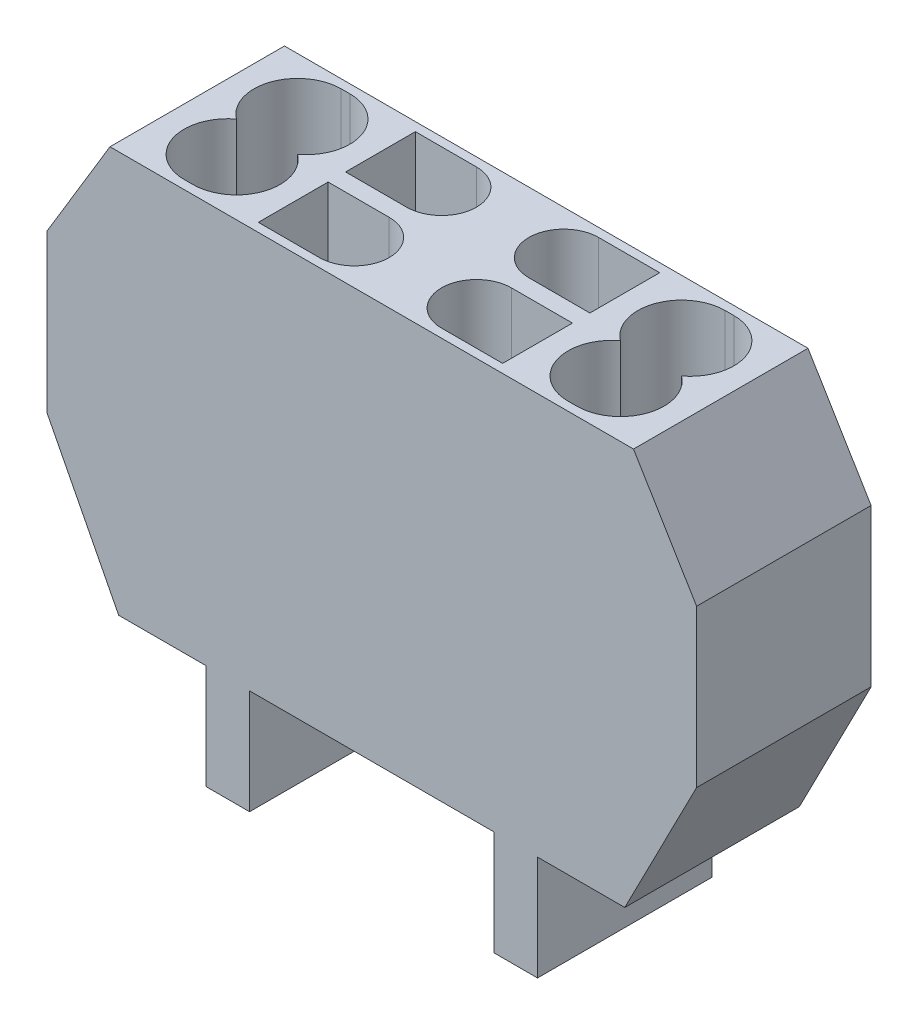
ISO-10303-21;
HEADER;
FILE_DESCRIPTION(('STEP AP214'),'2;1');
FILE_NAME('part.step','',(''),(''),'','','');
FILE_SCHEMA(('AUTOMOTIVE_DESIGN { 1 0 10303 214 1 1 1 1 }'));
ENDSEC;
DATA;
#1=APPLICATION_CONTEXT('core data for automotive mechanical design processes');
#2=APPLICATION_PROTOCOL_DEFINITION('international standard','automotive_design',2000,#1);
#3=PRODUCT_CONTEXT('',#1,'mechanical');
#4=PRODUCT('Part','Part','',(#3));
#5=PRODUCT_RELATED_PRODUCT_CATEGORY('part','',(#4));
#6=PRODUCT_DEFINITION_FORMATION('','',#4);
#7=PRODUCT_DEFINITION_CONTEXT('part definition',#1,'design');
#8=PRODUCT_DEFINITION('design','',#6,#7);
#9=PRODUCT_DEFINITION_SHAPE('','',#8);
#10=(LENGTH_UNIT() NAMED_UNIT(*) SI_UNIT(.MILLI.,.METRE.));
#11=(NAMED_UNIT(*) PLANE_ANGLE_UNIT() SI_UNIT($,.RADIAN.));
#12=(NAMED_UNIT(*) SI_UNIT($,.STERADIAN.) SOLID_ANGLE_UNIT());
#13=UNCERTAINTY_MEASURE_WITH_UNIT(LENGTH_MEASURE(1.E-05),#10,'distance_accuracy_value','');
#14=(GEOMETRIC_REPRESENTATION_CONTEXT(3) GLOBAL_UNCERTAINTY_ASSIGNED_CONTEXT((#13)) GLOBAL_UNIT_ASSIGNED_CONTEXT((#10,
#11,#12)) REPRESENTATION_CONTEXT('',''));
#15=CARTESIAN_POINT('',(0.,0.,0.));
#16=DIRECTION('',(0.,0.,1.));
#17=DIRECTION('',(1.,0.,0.));
#18=AXIS2_PLACEMENT_3D('',#15,#16,#17);
#19=CARTESIAN_POINT('',(7.,0.,10.));
#20=DIRECTION('',(1.,0.,0.));
#21=DIRECTION('',(0.,1.,0.));
#22=AXIS2_PLACEMENT_3D('',#19,#20,#21);
#23=PLANE('',#22);
#24=DIRECTION('',(0.,-1.,0.));
#25=VECTOR('',#24,1.);
#26=CARTESIAN_POINT('',(7.,0.,0.));
#27=LINE('',#26,#25);
#28=CARTESIAN_POINT('',(7.,0.,0.));
#29=VERTEX_POINT('',#28);
#30=CARTESIAN_POINT('',(7.,-6.,0.));
#31=VERTEX_POINT('',#30);
#32=EDGE_CURVE('E515',#29,#31,#27,.T.);
#33=ORIENTED_EDGE('',*,*,#32,.T.);
#34=DIRECTION('',(0.,0.,-1.));
#35=VECTOR('',#34,1.);
#36=CARTESIAN_POINT('',(7.,-6.,10.));
#37=LINE('',#36,#35);
#38=CARTESIAN_POINT('',(7.,-6.,10.));
#39=VERTEX_POINT('',#38);
#40=EDGE_CURVE('E11',#39,#31,#37,.T.);
#41=ORIENTED_EDGE('',*,*,#40,.F.);
#42=DIRECTION('',(0.,-1.,0.));
#43=VECTOR('',#42,1.);
#44=CARTESIAN_POINT('',(7.,0.,10.));
#45=LINE('',#44,#43);
#46=CARTESIAN_POINT('',(7.,0.,10.));
#47=VERTEX_POINT('',#46);
#48=EDGE_CURVE('E526',#47,#39,#45,.T.);
#49=ORIENTED_EDGE('',*,*,#48,.F.);
#50=DIRECTION('',(0.,0.,-1.));
#51=VECTOR('',#50,1.);
#52=CARTESIAN_POINT('',(7.,0.,10.));
#53=LINE('',#52,#51);
#54=EDGE_CURVE('E560',#47,#29,#53,.T.);
#55=ORIENTED_EDGE('',*,*,#54,.T.);
#56=EDGE_LOOP('',(#33,#41,#49,#55));
#57=FACE_BOUND('',#56,.T.);
#58=ADVANCED_FACE('F17',(#57),#23,.F.);
#59=CARTESIAN_POINT('',(7.,-6.,10.));
#60=DIRECTION('',(0.,1.,0.));
#61=DIRECTION('',(0.,0.,1.));
#62=AXIS2_PLACEMENT_3D('',#59,#60,#61);
#63=PLANE('',#62);
#64=DIRECTION('',(1.,0.,0.));
#65=VECTOR('',#64,1.);
#66=CARTESIAN_POINT('',(7.,-6.,0.));
#67=LINE('',#66,#65);
#68=CARTESIAN_POINT('',(9.5,-6.,0.));
#69=VERTEX_POINT('',#68);
#70=EDGE_CURVE('E563',#31,#69,#67,.T.);
#71=ORIENTED_EDGE('',*,*,#70,.T.);
#72=DIRECTION('',(0.,0.,-1.));
#73=VECTOR('',#72,1.);
#74=CARTESIAN_POINT('',(9.5,-6.,10.));
#75=LINE('',#74,#73);
#76=CARTESIAN_POINT('',(9.5,-6.,10.));
#77=VERTEX_POINT('',#76);
#78=EDGE_CURVE('E24',#77,#69,#75,.T.);
#79=ORIENTED_EDGE('',*,*,#78,.F.);
#80=DIRECTION('',(1.,0.,0.));
#81=VECTOR('',#80,1.);
#82=CARTESIAN_POINT('',(7.,-6.,10.));
#83=LINE('',#82,#81);
#84=EDGE_CURVE('E529',#39,#77,#83,.T.);
#85=ORIENTED_EDGE('',*,*,#84,.F.);
#86=ORIENTED_EDGE('',*,*,#40,.T.);
#87=EDGE_LOOP('',(#71,#79,#85,#86));
#88=FACE_BOUND('',#87,.T.);
#89=ADVANCED_FACE('F660',(#88),#63,.F.);
#90=CARTESIAN_POINT('',(9.5,-6.,10.));
#91=DIRECTION('',(-1.,0.,0.));
#92=DIRECTION('',(0.,0.,1.));
#93=AXIS2_PLACEMENT_3D('',#90,#91,#92);
#94=PLANE('',#93);
#95=DIRECTION('',(0.,1.,0.));
#96=VECTOR('',#95,1.);
#97=CARTESIAN_POINT('',(9.5,-6.,0.));
#98=LINE('',#97,#96);
#99=CARTESIAN_POINT('',(9.5,0.,0.));
#100=VERTEX_POINT('',#99);
#101=EDGE_CURVE('E565',#69,#100,#98,.T.);
#102=ORIENTED_EDGE('',*,*,#101,.T.);
#103=DIRECTION('',(0.,0.,-1.));
#104=VECTOR('',#103,1.);
#105=CARTESIAN_POINT('',(9.5,0.,10.));
#106=LINE('',#105,#104);
#107=CARTESIAN_POINT('',(9.5,0.,10.));
#108=VERTEX_POINT('',#107);
#109=EDGE_CURVE('E630',#108,#100,#106,.T.);
#110=ORIENTED_EDGE('',*,*,#109,.F.);
#111=DIRECTION('',(0.,1.,0.));
#112=VECTOR('',#111,1.);
#113=CARTESIAN_POINT('',(9.5,-6.,10.));
#114=LINE('',#113,#112);
#115=EDGE_CURVE('E532',#77,#108,#114,.T.);
#116=ORIENTED_EDGE('',*,*,#115,.F.);
#117=ORIENTED_EDGE('',*,*,#78,.T.);
#118=EDGE_LOOP('',(#102,#110,#116,#117));
#119=FACE_BOUND('',#118,.T.);
#120=ADVANCED_FACE('F637',(#119),#94,.F.);
#121=CARTESIAN_POINT('',(9.5,0.,10.));
#122=DIRECTION('',(0.,1.,0.));
#123=DIRECTION('',(0.,0.,1.));
#124=AXIS2_PLACEMENT_3D('',#121,#122,#123);
#125=PLANE('',#124);
#126=DIRECTION('',(1.,0.,0.));
#127=VECTOR('',#126,1.);
#128=CARTESIAN_POINT('',(9.5,0.,0.));
#129=LINE('',#128,#127);
#130=CARTESIAN_POINT('',(14.5,0.,0.));
#131=VERTEX_POINT('',#130);
#132=EDGE_CURVE('E567',#100,#131,#129,.T.);
#133=ORIENTED_EDGE('',*,*,#132,.T.);
#134=DIRECTION('',(0.,0.,-1.));
#135=VECTOR('',#134,1.);
#136=CARTESIAN_POINT('',(14.5,0.,10.));
#137=LINE('',#136,#135);
#138=CARTESIAN_POINT('',(14.5,0.,10.));
#139=VERTEX_POINT('',#138);
#140=EDGE_CURVE('E627',#139,#131,#137,.T.);
#141=ORIENTED_EDGE('',*,*,#140,.F.);
#142=DIRECTION('',(1.,0.,0.));
#143=VECTOR('',#142,1.);
#144=CARTESIAN_POINT('',(9.5,0.,10.));
#145=LINE('',#144,#143);
#146=EDGE_CURVE('E534',#108,#139,#145,.T.);
#147=ORIENTED_EDGE('',*,*,#146,.F.);
#148=ORIENTED_EDGE('',*,*,#109,.T.);
#149=EDGE_LOOP('',(#133,#141,#147,#148));
#150=FACE_BOUND('',#149,.T.);
#151=ADVANCED_FACE('F648',(#150),#125,.F.);
#152=CARTESIAN_POINT('',(14.5,0.,10.));
#153=DIRECTION('',(-0.889429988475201,0.457071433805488,0.));
#154=DIRECTION('',(-0.457071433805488,-0.889429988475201,0.));
#155=AXIS2_PLACEMENT_3D('',#152,#153,#154);
#156=PLANE('',#155);
#157=DIRECTION('',(0.457071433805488,0.889429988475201,0.));
#158=VECTOR('',#157,1.);
#159=CARTESIAN_POINT('',(14.5,0.,0.));
#160=LINE('',#159,#158);
#161=CARTESIAN_POINT('',(18.6136429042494,8.0048698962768,0.));
#162=VERTEX_POINT('',#161);
#163=EDGE_CURVE('E569',#131,#162,#160,.T.);
#164=ORIENTED_EDGE('',*,*,#163,.T.);
#165=DIRECTION('',(0.,0.,-1.));
#166=VECTOR('',#165,1.);
#167=CARTESIAN_POINT('',(18.6136429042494,8.0048698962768,10.));
#168=LINE('',#167,#166);
#169=CARTESIAN_POINT('',(18.6136429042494,8.0048698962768,10.));
#170=VERTEX_POINT('',#169);
#171=EDGE_CURVE('E624',#170,#162,#168,.T.);
#172=ORIENTED_EDGE('',*,*,#171,.F.);
#173=DIRECTION('',(0.457071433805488,0.889429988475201,0.));
#174=VECTOR('',#173,1.);
#175=CARTESIAN_POINT('',(14.5,0.,10.));
#176=LINE('',#175,#174);
#177=EDGE_CURVE('E536',#139,#170,#176,.T.);
#178=ORIENTED_EDGE('',*,*,#177,.F.);
#179=ORIENTED_EDGE('',*,*,#140,.T.);
#180=EDGE_LOOP('',(#164,#172,#178,#179));
#181=FACE_BOUND('',#180,.T.);
#182=ADVANCED_FACE('F652',(#181),#156,.F.);
#183=CARTESIAN_POINT('',(18.6136429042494,8.0048698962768,10.));
#184=DIRECTION('',(-1.,0.,0.));
#185=DIRECTION('',(0.,0.,1.));
#186=AXIS2_PLACEMENT_3D('',#183,#184,#185);
#187=PLANE('',#186);
#188=DIRECTION('',(0.,1.,0.));
#189=VECTOR('',#188,1.);
#190=CARTESIAN_POINT('',(18.6136429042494,8.0048698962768,0.));
#191=LINE('',#190,#189);
#192=CARTESIAN_POINT('',(18.6136429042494,17.0048698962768,0.));
#193=VERTEX_POINT('',#192);
#194=EDGE_CURVE('E571',#162,#193,#191,.T.);
#195=ORIENTED_EDGE('',*,*,#194,.T.);
#196=DIRECTION('',(0.,0.,-1.));
#197=VECTOR('',#196,1.);
#198=CARTESIAN_POINT('',(18.6136429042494,17.0048698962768,10.));
#199=LINE('',#198,#197);
#200=CARTESIAN_POINT('',(18.6136429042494,17.0048698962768,10.));
#201=VERTEX_POINT('',#200);
#202=EDGE_CURVE('E621',#201,#193,#199,.T.);
#203=ORIENTED_EDGE('',*,*,#202,.F.);
#204=DIRECTION('',(0.,1.,0.));
#205=VECTOR('',#204,1.);
#206=CARTESIAN_POINT('',(18.6136429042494,8.0048698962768,10.));
#207=LINE('',#206,#205);
#208=EDGE_CURVE('E538',#170,#201,#207,.T.);
#209=ORIENTED_EDGE('',*,*,#208,.F.);
#210=ORIENTED_EDGE('',*,*,#171,.T.);
#211=EDGE_LOOP('',(#195,#203,#209,#210));
#212=FACE_BOUND('',#211,.T.);
#213=ADVANCED_FACE('F713',(#212),#187,.F.);
#214=CARTESIAN_POINT('',(18.6136429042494,17.0048698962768,10.));
#215=DIRECTION('',(-0.856447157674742,-0.516234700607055,0.));
#216=DIRECTION('',(0.516234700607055,-0.856447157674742,0.));
#217=AXIS2_PLACEMENT_3D('',#214,#215,#216);
#218=PLANE('',#217);
#219=DIRECTION('',(-0.516234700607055,0.856447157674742,0.));
#220=VECTOR('',#219,1.);
#221=CARTESIAN_POINT('',(18.6136429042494,17.0048698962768,0.));
#222=LINE('',#221,#220);
#223=CARTESIAN_POINT('',(15.,23.,0.));
#224=VERTEX_POINT('',#223);
#225=EDGE_CURVE('E573',#193,#224,#222,.T.);
#226=ORIENTED_EDGE('',*,*,#225,.T.);
#227=DIRECTION('',(0.,0.,-1.));
#228=VECTOR('',#227,1.);
#229=CARTESIAN_POINT('',(15.,23.,10.));
#230=LINE('',#229,#228);
#231=CARTESIAN_POINT('',(15.,23.,10.));
#232=VERTEX_POINT('',#231);
#233=EDGE_CURVE('E618',#232,#224,#230,.T.);
#234=ORIENTED_EDGE('',*,*,#233,.F.);
#235=DIRECTION('',(-0.516234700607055,0.856447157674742,0.));
#236=VECTOR('',#235,1.);
#237=CARTESIAN_POINT('',(18.6136429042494,17.0048698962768,10.));
#238=LINE('',#237,#236);
#239=EDGE_CURVE('E540',#201,#232,#238,.T.);
#240=ORIENTED_EDGE('',*,*,#239,.F.);
#241=ORIENTED_EDGE('',*,*,#202,.T.);
#242=EDGE_LOOP('',(#226,#234,#240,#241));
#243=FACE_BOUND('',#242,.T.);
#244=ADVANCED_FACE('F710',(#243),#218,.F.);
#245=CARTESIAN_POINT('',(15.,23.,10.));
#246=DIRECTION('',(0.,-1.,0.));
#247=DIRECTION('',(0.,0.,-1.));
#248=AXIS2_PLACEMENT_3D('',#245,#246,#247);
#249=PLANE('',#248);
#250=DIRECTION('',(-1.,0.,0.));
#251=VECTOR('',#250,1.);
#252=CARTESIAN_POINT('',(-7.,23.,0.5));
#253=LINE('',#252,#251);
#254=CARTESIAN_POINT('',(-3.5,23.,0.5));
#255=VERTEX_POINT('',#254);
#256=CARTESIAN_POINT('',(-7.,23.,0.5));
#257=VERTEX_POINT('',#256);
#258=EDGE_CURVE('E326',#255,#257,#253,.T.);
#259=ORIENTED_EDGE('',*,*,#258,.F.);
#260=CARTESIAN_POINT('',(-3.5,23.,2.5));
#261=DIRECTION('',(0.,1.,0.));
#262=DIRECTION('',(0.,0.,-1.));
#263=AXIS2_PLACEMENT_3D('',#260,#261,#262);
#264=CIRCLE('',#263,2.);
#265=CARTESIAN_POINT('',(-3.5,23.,4.5));
#266=VERTEX_POINT('',#265);
#267=EDGE_CURVE('E31',#266,#255,#264,.T.);
#268=ORIENTED_EDGE('',*,*,#267,.F.);
#269=DIRECTION('',(1.,0.,0.));
#270=VECTOR('',#269,1.);
#271=CARTESIAN_POINT('',(-3.5,23.,4.5));
#272=LINE('',#271,#270);
#273=CARTESIAN_POINT('',(-7.,23.,4.5));
#274=VERTEX_POINT('',#273);
#275=EDGE_CURVE('E317',#274,#266,#272,.T.);
#276=ORIENTED_EDGE('',*,*,#275,.F.);
#277=DIRECTION('',(0.,0.,1.));
#278=VECTOR('',#277,1.);
#279=CARTESIAN_POINT('',(-7.,23.,4.5));
#280=LINE('',#279,#278);
#281=EDGE_CURVE('E320',#257,#274,#280,.T.);
#282=ORIENTED_EDGE('',*,*,#281,.F.);
#283=EDGE_LOOP('',(#259,#268,#276,#282));
#284=FACE_BOUND('',#283,.T.);
#285=DIRECTION('',(1.,0.,0.));
#286=VECTOR('',#285,1.);
#287=CARTESIAN_POINT('',(3.5,23.,4.5));
#288=LINE('',#287,#286);
#289=CARTESIAN_POINT('',(3.5,23.,4.5));
#290=VERTEX_POINT('',#289);
#291=CARTESIAN_POINT('',(7.,23.,4.5));
#292=VERTEX_POINT('',#291);
#293=EDGE_CURVE('E350',#290,#292,#288,.T.);
#294=ORIENTED_EDGE('',*,*,#293,.F.);
#295=CARTESIAN_POINT('',(3.5,23.,2.5));
#296=DIRECTION('',(0.,1.,0.));
#297=DIRECTION('',(0.,0.,1.));
#298=AXIS2_PLACEMENT_3D('',#295,#296,#297);
#299=CIRCLE('',#298,2.);
#300=CARTESIAN_POINT('',(3.5,23.,0.5));
#301=VERTEX_POINT('',#300);
#302=EDGE_CURVE('E39',#301,#290,#299,.T.);
#303=ORIENTED_EDGE('',*,*,#302,.F.);
#304=DIRECTION('',(-1.,0.,0.));
#305=VECTOR('',#304,1.);
#306=CARTESIAN_POINT('',(7.,23.,0.5));
#307=LINE('',#306,#305);
#308=CARTESIAN_POINT('',(7.,23.,0.5));
#309=VERTEX_POINT('',#308);
#310=EDGE_CURVE('E339',#309,#301,#307,.T.);
#311=ORIENTED_EDGE('',*,*,#310,.F.);
#312=DIRECTION('',(0.,0.,-1.));
#313=VECTOR('',#312,1.);
#314=CARTESIAN_POINT('',(7.,23.,4.5));
#315=LINE('',#314,#313);
#316=EDGE_CURVE('E353',#292,#309,#315,.T.);
#317=ORIENTED_EDGE('',*,*,#316,.F.);
#318=EDGE_LOOP('',(#294,#303,#311,#317));
#319=FACE_BOUND('',#318,.T.);
#320=DIRECTION('',(1.,0.,0.));
#321=VECTOR('',#320,1.);
#322=CARTESIAN_POINT('',(7.,23.,9.5));
#323=LINE('',#322,#321);
#324=CARTESIAN_POINT('',(3.5,23.,9.5));
#325=VERTEX_POINT('',#324);
#326=CARTESIAN_POINT('',(7.,23.,9.5));
#327=VERTEX_POINT('',#326);
#328=EDGE_CURVE('E381',#325,#327,#323,.T.);
#329=ORIENTED_EDGE('',*,*,#328,.F.);
#330=CARTESIAN_POINT('',(3.5,23.,7.5));
#331=DIRECTION('',(0.,1.,0.));
#332=DIRECTION('',(0.,0.,-1.));
#333=AXIS2_PLACEMENT_3D('',#330,#331,#332);
#334=CIRCLE('',#333,2.);
#335=CARTESIAN_POINT('',(3.5,23.,5.5));
#336=VERTEX_POINT('',#335);
#337=EDGE_CURVE('E360',#336,#325,#334,.T.);
#338=ORIENTED_EDGE('',*,*,#337,.F.);
#339=DIRECTION('',(-1.,0.,0.));
#340=VECTOR('',#339,1.);
#341=CARTESIAN_POINT('',(3.5,23.,5.5));
#342=LINE('',#341,#340);
#343=CARTESIAN_POINT('',(7.,23.,5.5));
#344=VERTEX_POINT('',#343);
#345=EDGE_CURVE('E370',#344,#336,#342,.T.);
#346=ORIENTED_EDGE('',*,*,#345,.F.);
#347=DIRECTION('',(0.,0.,-1.));
#348=VECTOR('',#347,1.);
#349=CARTESIAN_POINT('',(7.,23.,5.5));
#350=LINE('',#349,#348);
#351=EDGE_CURVE('E384',#327,#344,#350,.T.);
#352=ORIENTED_EDGE('',*,*,#351,.F.);
#353=EDGE_LOOP('',(#329,#338,#346,#352));
#354=FACE_BOUND('',#353,.T.);
#355=DIRECTION('',(0.,0.,1.));
#356=VECTOR('',#355,1.);
#357=CARTESIAN_POINT('',(-7.,23.,5.5));
#358=LINE('',#357,#356);
#359=CARTESIAN_POINT('',(-7.,23.,5.5));
#360=VERTEX_POINT('',#359);
#361=CARTESIAN_POINT('',(-7.,23.,9.5));
#362=VERTEX_POINT('',#361);
#363=EDGE_CURVE('E413',#360,#362,#358,.T.);
#364=ORIENTED_EDGE('',*,*,#363,.F.);
#365=DIRECTION('',(-1.,0.,0.));
#366=VECTOR('',#365,1.);
#367=CARTESIAN_POINT('',(-3.5,23.,5.5));
#368=LINE('',#367,#366);
#369=CARTESIAN_POINT('',(-3.5,23.,5.5));
#370=VERTEX_POINT('',#369);
#371=EDGE_CURVE('E391',#370,#360,#368,.T.);
#372=ORIENTED_EDGE('',*,*,#371,.F.);
#373=CARTESIAN_POINT('',(-3.5,23.,7.5));
#374=DIRECTION('',(0.,1.,0.));
#375=DIRECTION('',(0.,0.,1.));
#376=AXIS2_PLACEMENT_3D('',#373,#374,#375);
#377=CIRCLE('',#376,2.);
#378=CARTESIAN_POINT('',(-3.5,23.,9.5));
#379=VERTEX_POINT('',#378);
#380=EDGE_CURVE('E402',#379,#370,#377,.T.);
#381=ORIENTED_EDGE('',*,*,#380,.F.);
#382=DIRECTION('',(1.,0.,0.));
#383=VECTOR('',#382,1.);
#384=CARTESIAN_POINT('',(-7.,23.,9.5));
#385=LINE('',#384,#383);
#386=EDGE_CURVE('E416',#362,#379,#385,.T.);
#387=ORIENTED_EDGE('',*,*,#386,.F.);
#388=EDGE_LOOP('',(#364,#372,#381,#387));
#389=FACE_BOUND('',#388,.T.);
#390=DIRECTION('',(-1.,0.,0.));
#391=VECTOR('',#390,1.);
#392=CARTESIAN_POINT('',(10.75,23.,0.5));
#393=LINE('',#392,#391);
#394=CARTESIAN_POINT('',(11.25,23.,0.5));
#395=VERTEX_POINT('',#394);
#396=CARTESIAN_POINT('',(10.75,23.,0.5));
#397=VERTEX_POINT('',#396);
#398=EDGE_CURVE('E451',#395,#397,#393,.T.);
#399=ORIENTED_EDGE('',*,*,#398,.F.);
#400=CARTESIAN_POINT('',(11.25,23.,3.));
#401=DIRECTION('',(0.,1.,0.));
#402=DIRECTION('',(0.,0.,-1.));
#403=AXIS2_PLACEMENT_3D('',#400,#401,#402);
#404=CIRCLE('',#403,2.5);
#405=CARTESIAN_POINT('',(12.75,23.,5.));
#406=VERTEX_POINT('',#405);
#407=EDGE_CURVE('E423',#406,#395,#404,.T.);
#408=ORIENTED_EDGE('',*,*,#407,.F.);
#409=CARTESIAN_POINT('',(11.25,23.,7.));
#410=DIRECTION('',(0.,1.,0.));
#411=DIRECTION('',(0.,0.,1.));
#412=AXIS2_PLACEMENT_3D('',#409,#410,#411);
#413=CIRCLE('',#412,2.5);
#414=CARTESIAN_POINT('',(11.25,23.,9.5));
#415=VERTEX_POINT('',#414);
#416=EDGE_CURVE('E434',#415,#406,#413,.T.);
#417=ORIENTED_EDGE('',*,*,#416,.F.);
#418=DIRECTION('',(1.,0.,0.));
#419=VECTOR('',#418,1.);
#420=CARTESIAN_POINT('',(10.75,23.,9.5));
#421=LINE('',#420,#419);
#422=CARTESIAN_POINT('',(10.75,23.,9.5));
#423=VERTEX_POINT('',#422);
#424=EDGE_CURVE('E460',#423,#415,#421,.T.);
#425=ORIENTED_EDGE('',*,*,#424,.F.);
#426=CARTESIAN_POINT('',(10.75,23.,7.));
#427=DIRECTION('',(0.,1.,0.));
#428=DIRECTION('',(0.,0.,1.));
#429=AXIS2_PLACEMENT_3D('',#426,#427,#428);
#430=CIRCLE('',#429,2.5);
#431=CARTESIAN_POINT('',(9.25,23.,5.));
#432=VERTEX_POINT('',#431);
#433=EDGE_CURVE('E457',#432,#423,#430,.T.);
#434=ORIENTED_EDGE('',*,*,#433,.F.);
#435=CARTESIAN_POINT('',(10.75,23.,3.));
#436=DIRECTION('',(0.,1.,0.));
#437=DIRECTION('',(0.,0.,-1.));
#438=AXIS2_PLACEMENT_3D('',#435,#436,#437);
#439=CIRCLE('',#438,2.5);
#440=EDGE_CURVE('E454',#397,#432,#439,.T.);
#441=ORIENTED_EDGE('',*,*,#440,.F.);
#442=EDGE_LOOP('',(#399,#408,#417,#425,#434,#441));
#443=FACE_BOUND('',#442,.T.);
#444=DIRECTION('',(1.,0.,0.));
#445=VECTOR('',#444,1.);
#446=CARTESIAN_POINT('',(-10.75,23.,9.5));
#447=LINE('',#446,#445);
#448=CARTESIAN_POINT('',(-11.25,23.,9.5));
#449=VERTEX_POINT('',#448);
#450=CARTESIAN_POINT('',(-10.75,23.,9.5));
#451=VERTEX_POINT('',#450);
#452=EDGE_CURVE('E499',#449,#451,#447,.T.);
#453=ORIENTED_EDGE('',*,*,#452,.F.);
#454=CARTESIAN_POINT('',(-11.25,23.,7.));
#455=DIRECTION('',(0.,1.,0.));
#456=DIRECTION('',(0.,0.,-1.));
#457=AXIS2_PLACEMENT_3D('',#454,#455,#456);
#458=CIRCLE('',#457,2.5);
#459=CARTESIAN_POINT('',(-12.75,23.,5.));
#460=VERTEX_POINT('',#459);
#461=EDGE_CURVE('E467',#460,#449,#458,.T.);
#462=ORIENTED_EDGE('',*,*,#461,.F.);
#463=CARTESIAN_POINT('',(-11.25,23.,3.));
#464=DIRECTION('',(0.,1.,0.));
#465=DIRECTION('',(0.,0.,1.));
#466=AXIS2_PLACEMENT_3D('',#463,#464,#465);
#467=CIRCLE('',#466,2.5);
#468=CARTESIAN_POINT('',(-11.25,23.,0.5));
#469=VERTEX_POINT('',#468);
#470=EDGE_CURVE('E482',#469,#460,#467,.T.);
#471=ORIENTED_EDGE('',*,*,#470,.F.);
#472=DIRECTION('',(-1.,0.,0.));
#473=VECTOR('',#472,1.);
#474=CARTESIAN_POINT('',(-10.75,23.,0.5));
#475=LINE('',#474,#473);
#476=CARTESIAN_POINT('',(-10.75,23.,0.5));
#477=VERTEX_POINT('',#476);
#478=EDGE_CURVE('E508',#477,#469,#475,.T.);
#479=ORIENTED_EDGE('',*,*,#478,.F.);
#480=CARTESIAN_POINT('',(-10.75,23.,3.));
#481=DIRECTION('',(0.,1.,0.));
#482=DIRECTION('',(0.,0.,1.));
#483=AXIS2_PLACEMENT_3D('',#480,#481,#482);
#484=CIRCLE('',#483,2.5);
#485=CARTESIAN_POINT('',(-9.25,23.,5.));
#486=VERTEX_POINT('',#485);
#487=EDGE_CURVE('E505',#486,#477,#484,.T.);
#488=ORIENTED_EDGE('',*,*,#487,.F.);
#489=CARTESIAN_POINT('',(-10.75,23.,7.));
#490=DIRECTION('',(0.,1.,0.));
#491=DIRECTION('',(0.,0.,-1.));
#492=AXIS2_PLACEMENT_3D('',#489,#490,#491);
#493=CIRCLE('',#492,2.5);
#494=EDGE_CURVE('E502',#451,#486,#493,.T.);
#495=ORIENTED_EDGE('',*,*,#494,.F.);
#496=EDGE_LOOP('',(#453,#462,#471,#479,#488,#495));
#497=FACE_BOUND('',#496,.T.);
#498=DIRECTION('',(-1.,0.,0.));
#499=VECTOR('',#498,1.);
#500=CARTESIAN_POINT('',(15.,23.,0.));
#501=LINE('',#500,#499);
#502=CARTESIAN_POINT('',(-15.,23.,0.));
#503=VERTEX_POINT('',#502);
#504=EDGE_CURVE('E575',#224,#503,#501,.T.);
#505=ORIENTED_EDGE('',*,*,#504,.T.);
#506=DIRECTION('',(0.,0.,-1.));
#507=VECTOR('',#506,1.);
#508=CARTESIAN_POINT('',(-15.,23.,10.));
#509=LINE('',#508,#507);
#510=CARTESIAN_POINT('',(-15.,23.,10.));
#511=VERTEX_POINT('',#510);
#512=EDGE_CURVE('E615',#511,#503,#509,.T.);
#513=ORIENTED_EDGE('',*,*,#512,.F.);
#514=DIRECTION('',(-1.,0.,0.));
#515=VECTOR('',#514,1.);
#516=CARTESIAN_POINT('',(15.,23.,10.));
#517=LINE('',#516,#515);
#518=EDGE_CURVE('E542',#232,#511,#517,.T.);
#519=ORIENTED_EDGE('',*,*,#518,.F.);
#520=ORIENTED_EDGE('',*,*,#233,.T.);
#521=EDGE_LOOP('',(#505,#513,#519,#520));
#522=FACE_BOUND('',#521,.T.);
#523=ADVANCED_FACE('F706',(#284,#319,#354,#389,#443,#497,#522),#249,.F.);
#524=CARTESIAN_POINT('',(-18.6136429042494,17.0048698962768,10.));
#525=DIRECTION('',(0.856447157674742,-0.516234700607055,0.));
#526=DIRECTION('',(0.516234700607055,0.856447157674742,0.));
#527=AXIS2_PLACEMENT_3D('',#524,#525,#526);
#528=PLANE('',#527);
#529=DIRECTION('',(-0.516234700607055,-0.856447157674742,0.));
#530=VECTOR('',#529,1.);
#531=CARTESIAN_POINT('',(-18.6136429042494,17.0048698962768,0.));
#532=LINE('',#531,#530);
#533=CARTESIAN_POINT('',(-18.6136429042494,17.0048698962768,0.));
#534=VERTEX_POINT('',#533);
#535=EDGE_CURVE('E577',#503,#534,#532,.T.);
#536=ORIENTED_EDGE('',*,*,#535,.T.);
#537=DIRECTION('',(0.,0.,-1.));
#538=VECTOR('',#537,1.);
#539=CARTESIAN_POINT('',(-18.6136429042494,17.0048698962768,10.));
#540=LINE('',#539,#538);
#541=CARTESIAN_POINT('',(-18.6136429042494,17.0048698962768,10.));
#542=VERTEX_POINT('',#541);
#543=EDGE_CURVE('E612',#542,#534,#540,.T.);
#544=ORIENTED_EDGE('',*,*,#543,.F.);
#545=DIRECTION('',(-0.516234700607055,-0.856447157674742,0.));
#546=VECTOR('',#545,1.);
#547=CARTESIAN_POINT('',(-18.6136429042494,17.0048698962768,10.));
#548=LINE('',#547,#546);
#549=EDGE_CURVE('E544',#511,#542,#548,.T.);
#550=ORIENTED_EDGE('',*,*,#549,.F.);
#551=ORIENTED_EDGE('',*,*,#512,.T.);
#552=EDGE_LOOP('',(#536,#544,#550,#551));
#553=FACE_BOUND('',#552,.T.);
#554=ADVANCED_FACE('F702',(#553),#528,.F.);
#555=CARTESIAN_POINT('',(-18.6136429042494,8.0048698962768,10.));
#556=DIRECTION('',(1.,0.,0.));
#557=DIRECTION('',(0.,0.,-1.));
#558=AXIS2_PLACEMENT_3D('',#555,#556,#557);
#559=PLANE('',#558);
#560=DIRECTION('',(0.,-1.,0.));
#561=VECTOR('',#560,1.);
#562=CARTESIAN_POINT('',(-18.6136429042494,8.0048698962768,0.));
#563=LINE('',#562,#561);
#564=CARTESIAN_POINT('',(-18.6136429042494,8.0048698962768,0.));
#565=VERTEX_POINT('',#564);
#566=EDGE_CURVE('E579',#534,#565,#563,.T.);
#567=ORIENTED_EDGE('',*,*,#566,.T.);
#568=DIRECTION('',(0.,0.,-1.));
#569=VECTOR('',#568,1.);
#570=CARTESIAN_POINT('',(-18.6136429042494,8.0048698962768,10.));
#571=LINE('',#570,#569);
#572=CARTESIAN_POINT('',(-18.6136429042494,8.0048698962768,10.));
#573=VERTEX_POINT('',#572);
#574=EDGE_CURVE('E609',#573,#565,#571,.T.);
#575=ORIENTED_EDGE('',*,*,#574,.F.);
#576=DIRECTION('',(0.,-1.,0.));
#577=VECTOR('',#576,1.);
#578=CARTESIAN_POINT('',(-18.6136429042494,8.0048698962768,10.));
#579=LINE('',#578,#577);
#580=EDGE_CURVE('E546',#542,#573,#579,.T.);
#581=ORIENTED_EDGE('',*,*,#580,.F.);
#582=ORIENTED_EDGE('',*,*,#543,.T.);
#583=EDGE_LOOP('',(#567,#575,#581,#582));
#584=FACE_BOUND('',#583,.T.);
#585=ADVANCED_FACE('F697',(#584),#559,.F.);
#586=CARTESIAN_POINT('',(-14.5,0.,10.));
#587=DIRECTION('',(0.889429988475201,0.457071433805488,0.));
#588=DIRECTION('',(-0.457071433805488,0.889429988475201,0.));
#589=AXIS2_PLACEMENT_3D('',#586,#587,#588);
#590=PLANE('',#589);
#591=DIRECTION('',(0.457071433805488,-0.889429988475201,0.));
#592=VECTOR('',#591,1.);
#593=CARTESIAN_POINT('',(-14.5,0.,0.));
#594=LINE('',#593,#592);
#595=CARTESIAN_POINT('',(-14.5,0.,0.));
#596=VERTEX_POINT('',#595);
#597=EDGE_CURVE('E581',#565,#596,#594,.T.);
#598=ORIENTED_EDGE('',*,*,#597,.T.);
#599=DIRECTION('',(0.,0.,-1.));
#600=VECTOR('',#599,1.);
#601=CARTESIAN_POINT('',(-14.5,0.,10.));
#602=LINE('',#601,#600);
#603=CARTESIAN_POINT('',(-14.5,0.,10.));
#604=VERTEX_POINT('',#603);
#605=EDGE_CURVE('E606',#604,#596,#602,.T.);
#606=ORIENTED_EDGE('',*,*,#605,.F.);
#607=DIRECTION('',(0.457071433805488,-0.889429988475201,0.));
#608=VECTOR('',#607,1.);
#609=CARTESIAN_POINT('',(-14.5,0.,10.));
#610=LINE('',#609,#608);
#611=EDGE_CURVE('E548',#573,#604,#610,.T.);
#612=ORIENTED_EDGE('',*,*,#611,.F.);
#613=ORIENTED_EDGE('',*,*,#574,.T.);
#614=EDGE_LOOP('',(#598,#606,#612,#613));
#615=FACE_BOUND('',#614,.T.);
#616=ADVANCED_FACE('F691',(#615),#590,.F.);
#617=CARTESIAN_POINT('',(-9.5,0.,10.));
#618=DIRECTION('',(0.,1.,0.));
#619=DIRECTION('',(0.,0.,1.));
#620=AXIS2_PLACEMENT_3D('',#617,#618,#619);
#621=PLANE('',#620);
#622=DIRECTION('',(1.,0.,0.));
#623=VECTOR('',#622,1.);
#624=CARTESIAN_POINT('',(-9.5,0.,0.));
#625=LINE('',#624,#623);
#626=CARTESIAN_POINT('',(-9.5,0.,0.));
#627=VERTEX_POINT('',#626);
#628=EDGE_CURVE('E583',#596,#627,#625,.T.);
#629=ORIENTED_EDGE('',*,*,#628,.T.);
#630=DIRECTION('',(0.,0.,-1.));
#631=VECTOR('',#630,1.);
#632=CARTESIAN_POINT('',(-9.5,0.,10.));
#633=LINE('',#632,#631);
#634=CARTESIAN_POINT('',(-9.5,0.,10.));
#635=VERTEX_POINT('',#634);
#636=EDGE_CURVE('E603',#635,#627,#633,.T.);
#637=ORIENTED_EDGE('',*,*,#636,.F.);
#638=DIRECTION('',(1.,0.,0.));
#639=VECTOR('',#638,1.);
#640=CARTESIAN_POINT('',(-9.5,0.,10.));
#641=LINE('',#640,#639);
#642=EDGE_CURVE('E550',#604,#635,#641,.T.);
#643=ORIENTED_EDGE('',*,*,#642,.F.);
#644=ORIENTED_EDGE('',*,*,#605,.T.);
#645=EDGE_LOOP('',(#629,#637,#643,#644));
#646=FACE_BOUND('',#645,.T.);
#647=ADVANCED_FACE('F687',(#646),#621,.F.);
#648=CARTESIAN_POINT('',(-9.5,-6.,10.));
#649=DIRECTION('',(1.,0.,0.));
#650=DIRECTION('',(0.,0.,-1.));
#651=AXIS2_PLACEMENT_3D('',#648,#649,#650);
#652=PLANE('',#651);
#653=DIRECTION('',(0.,-1.,0.));
#654=VECTOR('',#653,1.);
#655=CARTESIAN_POINT('',(-9.5,-6.,0.));
#656=LINE('',#655,#654);
#657=CARTESIAN_POINT('',(-9.5,-6.,0.));
#658=VERTEX_POINT('',#657);
#659=EDGE_CURVE('E585',#627,#658,#656,.T.);
#660=ORIENTED_EDGE('',*,*,#659,.T.);
#661=DIRECTION('',(0.,0.,-1.));
#662=VECTOR('',#661,1.);
#663=CARTESIAN_POINT('',(-9.5,-6.,10.));
#664=LINE('',#663,#662);
#665=CARTESIAN_POINT('',(-9.5,-6.,10.));
#666=VERTEX_POINT('',#665);
#667=EDGE_CURVE('E600',#666,#658,#664,.T.);
#668=ORIENTED_EDGE('',*,*,#667,.F.);
#669=DIRECTION('',(0.,-1.,0.));
#670=VECTOR('',#669,1.);
#671=CARTESIAN_POINT('',(-9.5,-6.,10.));
#672=LINE('',#671,#670);
#673=EDGE_CURVE('E552',#635,#666,#672,.T.);
#674=ORIENTED_EDGE('',*,*,#673,.F.);
#675=ORIENTED_EDGE('',*,*,#636,.T.);
#676=EDGE_LOOP('',(#660,#668,#674,#675));
#677=FACE_BOUND('',#676,.T.);
#678=ADVANCED_FACE('F682',(#677),#652,.F.);
#679=CARTESIAN_POINT('',(-7.,-6.,10.));
#680=DIRECTION('',(0.,1.,0.));
#681=DIRECTION('',(0.,0.,1.));
#682=AXIS2_PLACEMENT_3D('',#679,#680,#681);
#683=PLANE('',#682);
#684=DIRECTION('',(1.,0.,0.));
#685=VECTOR('',#684,1.);
#686=CARTESIAN_POINT('',(-7.,-6.,0.));
#687=LINE('',#686,#685);
#688=CARTESIAN_POINT('',(-7.,-6.,0.));
#689=VERTEX_POINT('',#688);
#690=EDGE_CURVE('E587',#658,#689,#687,.T.);
#691=ORIENTED_EDGE('',*,*,#690,.T.);
#692=DIRECTION('',(0.,0.,-1.));
#693=VECTOR('',#692,1.);
#694=CARTESIAN_POINT('',(-7.,-6.,10.));
#695=LINE('',#694,#693);
#696=CARTESIAN_POINT('',(-7.,-6.,10.));
#697=VERTEX_POINT('',#696);
#698=EDGE_CURVE('E597',#697,#689,#695,.T.);
#699=ORIENTED_EDGE('',*,*,#698,.F.);
#700=DIRECTION('',(1.,0.,0.));
#701=VECTOR('',#700,1.);
#702=CARTESIAN_POINT('',(-7.,-6.,10.));
#703=LINE('',#702,#701);
#704=EDGE_CURVE('E554',#666,#697,#703,.T.);
#705=ORIENTED_EDGE('',*,*,#704,.F.);
#706=ORIENTED_EDGE('',*,*,#667,.T.);
#707=EDGE_LOOP('',(#691,#699,#705,#706));
#708=FACE_BOUND('',#707,.T.);
#709=ADVANCED_FACE('F676',(#708),#683,.F.);
#710=CARTESIAN_POINT('',(-7.,0.,10.));
#711=DIRECTION('',(-1.,0.,0.));
#712=DIRECTION('',(0.,-1.,0.));
#713=AXIS2_PLACEMENT_3D('',#710,#711,#712);
#714=PLANE('',#713);
#715=DIRECTION('',(0.,1.,0.));
#716=VECTOR('',#715,1.);
#717=CARTESIAN_POINT('',(-7.,0.,0.));
#718=LINE('',#717,#716);
#719=CARTESIAN_POINT('',(-7.,0.,0.));
#720=VERTEX_POINT('',#719);
#721=EDGE_CURVE('E589',#689,#720,#718,.T.);
#722=ORIENTED_EDGE('',*,*,#721,.T.);
#723=DIRECTION('',(0.,0.,-1.));
#724=VECTOR('',#723,1.);
#725=CARTESIAN_POINT('',(-7.,0.,10.));
#726=LINE('',#725,#724);
#727=CARTESIAN_POINT('',(-7.,0.,10.));
#728=VERTEX_POINT('',#727);
#729=EDGE_CURVE('E594',#728,#720,#726,.T.);
#730=ORIENTED_EDGE('',*,*,#729,.F.);
#731=DIRECTION('',(0.,1.,0.));
#732=VECTOR('',#731,1.);
#733=CARTESIAN_POINT('',(-7.,0.,10.));
#734=LINE('',#733,#732);
#735=EDGE_CURVE('E556',#697,#728,#734,.T.);
#736=ORIENTED_EDGE('',*,*,#735,.F.);
#737=ORIENTED_EDGE('',*,*,#698,.T.);
#738=EDGE_LOOP('',(#722,#730,#736,#737));
#739=FACE_BOUND('',#738,.T.);
#740=ADVANCED_FACE('F672',(#739),#714,.F.);
#741=CARTESIAN_POINT('',(-7.,0.,10.));
#742=DIRECTION('',(0.,1.,0.));
#743=DIRECTION('',(0.,0.,1.));
#744=AXIS2_PLACEMENT_3D('',#741,#742,#743);
#745=PLANE('',#744);
#746=DIRECTION('',(1.,0.,0.));
#747=VECTOR('',#746,1.);
#748=CARTESIAN_POINT('',(-7.,0.,0.));
#749=LINE('',#748,#747);
#750=EDGE_CURVE('E530',#720,#29,#749,.T.);
#751=ORIENTED_EDGE('',*,*,#750,.T.);
#752=ORIENTED_EDGE('',*,*,#54,.F.);
#753=DIRECTION('',(1.,0.,0.));
#754=VECTOR('',#753,1.);
#755=CARTESIAN_POINT('',(-7.,0.,10.));
#756=LINE('',#755,#754);
#757=EDGE_CURVE('E558',#728,#47,#756,.T.);
#758=ORIENTED_EDGE('',*,*,#757,.F.);
#759=ORIENTED_EDGE('',*,*,#729,.T.);
#760=EDGE_LOOP('',(#751,#752,#758,#759));
#761=FACE_BOUND('',#760,.T.);
#762=ADVANCED_FACE('F667',(#761),#745,.F.);
#763=CARTESIAN_POINT('',(7.,-6.,10.));
#764=DIRECTION('',(0.,0.,1.));
#765=DIRECTION('',(1.,0.,0.));
#766=AXIS2_PLACEMENT_3D('',#763,#764,#765);
#767=PLANE('',#766);
#768=ORIENTED_EDGE('',*,*,#48,.T.);
#769=ORIENTED_EDGE('',*,*,#84,.T.);
#770=ORIENTED_EDGE('',*,*,#115,.T.);
#771=ORIENTED_EDGE('',*,*,#146,.T.);
#772=ORIENTED_EDGE('',*,*,#177,.T.);
#773=ORIENTED_EDGE('',*,*,#208,.T.);
#774=ORIENTED_EDGE('',*,*,#239,.T.);
#775=ORIENTED_EDGE('',*,*,#518,.T.);
#776=ORIENTED_EDGE('',*,*,#549,.T.);
#777=ORIENTED_EDGE('',*,*,#580,.T.);
#778=ORIENTED_EDGE('',*,*,#611,.T.);
#779=ORIENTED_EDGE('',*,*,#642,.T.);
#780=ORIENTED_EDGE('',*,*,#673,.T.);
#781=ORIENTED_EDGE('',*,*,#704,.T.);
#782=ORIENTED_EDGE('',*,*,#735,.T.);
#783=ORIENTED_EDGE('',*,*,#757,.T.);
#784=EDGE_LOOP('',(#768,#769,#770,#771,#772,#773,#774,#775,#776,#777,#778,#779,#780,#781,#782,#783));
#785=FACE_BOUND('',#784,.T.);
#786=ADVANCED_FACE('F656',(#785),#767,.T.);
#787=CARTESIAN_POINT('',(7.,-6.,0.));
#788=DIRECTION('',(0.,0.,1.));
#789=DIRECTION('',(1.,0.,0.));
#790=AXIS2_PLACEMENT_3D('',#787,#788,#789);
#791=PLANE('',#790);
#792=ORIENTED_EDGE('',*,*,#32,.F.);
#793=ORIENTED_EDGE('',*,*,#750,.F.);
#794=ORIENTED_EDGE('',*,*,#721,.F.);
#795=ORIENTED_EDGE('',*,*,#690,.F.);
#796=ORIENTED_EDGE('',*,*,#659,.F.);
#797=ORIENTED_EDGE('',*,*,#628,.F.);
#798=ORIENTED_EDGE('',*,*,#597,.F.);
#799=ORIENTED_EDGE('',*,*,#566,.F.);
#800=ORIENTED_EDGE('',*,*,#535,.F.);
#801=ORIENTED_EDGE('',*,*,#504,.F.);
#802=ORIENTED_EDGE('',*,*,#225,.F.);
#803=ORIENTED_EDGE('',*,*,#194,.F.);
#804=ORIENTED_EDGE('',*,*,#163,.F.);
#805=ORIENTED_EDGE('',*,*,#132,.F.);
#806=ORIENTED_EDGE('',*,*,#101,.F.);
#807=ORIENTED_EDGE('',*,*,#70,.F.);
#808=EDGE_LOOP('',(#792,#793,#794,#795,#796,#797,#798,#799,#800,#801,#802,#803,#804,#805,#806,#807));
#809=FACE_BOUND('',#808,.T.);
#810=ADVANCED_FACE('F643',(#809),#791,.F.);
#811=CARTESIAN_POINT('',(-11.25,13.,7.));
#812=DIRECTION('',(0.,1.,0.));
#813=DIRECTION('',(0.,0.,1.));
#814=AXIS2_PLACEMENT_3D('',#811,#812,#813);
#815=CYLINDRICAL_SURFACE('',#814,2.5);
#816=ORIENTED_EDGE('',*,*,#461,.T.);
#817=DIRECTION('',(0.,1.,0.));
#818=VECTOR('',#817,1.);
#819=CARTESIAN_POINT('',(-11.25,13.,9.5));
#820=LINE('',#819,#818);
#821=CARTESIAN_POINT('',(-11.25,13.,9.5));
#822=VERTEX_POINT('',#821);
#823=EDGE_CURVE('E497',#822,#449,#820,.T.);
#824=ORIENTED_EDGE('',*,*,#823,.F.);
#825=CARTESIAN_POINT('',(-11.25,13.,7.));
#826=DIRECTION('',(0.,1.,0.));
#827=DIRECTION('',(0.,0.,-1.));
#828=AXIS2_PLACEMENT_3D('',#825,#826,#827);
#829=CIRCLE('',#828,2.5);
#830=CARTESIAN_POINT('',(-12.75,13.,5.));
#831=VERTEX_POINT('',#830);
#832=EDGE_CURVE('E478',#831,#822,#829,.T.);
#833=ORIENTED_EDGE('',*,*,#832,.F.);
#834=DIRECTION('',(0.,1.,0.));
#835=VECTOR('',#834,1.);
#836=CARTESIAN_POINT('',(-12.75,13.,5.));
#837=LINE('',#836,#835);
#838=EDGE_CURVE('E513',#831,#460,#837,.T.);
#839=ORIENTED_EDGE('',*,*,#838,.T.);
#840=EDGE_LOOP('',(#816,#824,#833,#839));
#841=FACE_BOUND('',#840,.T.);
#842=ADVANCED_FACE('F827',(#841),#815,.F.);
#843=CARTESIAN_POINT('',(-11.25,13.,3.));
#844=DIRECTION('',(0.,1.,0.));
#845=DIRECTION('',(0.,0.,1.));
#846=AXIS2_PLACEMENT_3D('',#843,#844,#845);
#847=CYLINDRICAL_SURFACE('',#846,2.5);
#848=ORIENTED_EDGE('',*,*,#470,.T.);
#849=ORIENTED_EDGE('',*,*,#838,.F.);
#850=CARTESIAN_POINT('',(-11.25,13.,3.));
#851=DIRECTION('',(0.,1.,0.));
#852=DIRECTION('',(0.,0.,1.));
#853=AXIS2_PLACEMENT_3D('',#850,#851,#852);
#854=CIRCLE('',#853,2.5);
#855=CARTESIAN_POINT('',(-11.25,13.,0.5));
#856=VERTEX_POINT('',#855);
#857=EDGE_CURVE('E494',#856,#831,#854,.T.);
#858=ORIENTED_EDGE('',*,*,#857,.F.);
#859=DIRECTION('',(0.,1.,0.));
#860=VECTOR('',#859,1.);
#861=CARTESIAN_POINT('',(-11.25,13.,0.5));
#862=LINE('',#861,#860);
#863=EDGE_CURVE('E516',#856,#469,#862,.T.);
#864=ORIENTED_EDGE('',*,*,#863,.T.);
#865=EDGE_LOOP('',(#848,#849,#858,#864));
#866=FACE_BOUND('',#865,.T.);
#867=ADVANCED_FACE('F833',(#866),#847,.F.);
#868=CARTESIAN_POINT('',(-10.75,13.,0.5));
#869=DIRECTION('',(0.,0.,-1.));
#870=DIRECTION('',(-1.,0.,0.));
#871=AXIS2_PLACEMENT_3D('',#868,#869,#870);
#872=PLANE('',#871);
#873=ORIENTED_EDGE('',*,*,#478,.T.);
#874=ORIENTED_EDGE('',*,*,#863,.F.);
#875=DIRECTION('',(-1.,0.,0.));
#876=VECTOR('',#875,1.);
#877=CARTESIAN_POINT('',(-10.75,13.,0.5));
#878=LINE('',#877,#876);
#879=CARTESIAN_POINT('',(-10.75,13.,0.5));
#880=VERTEX_POINT('',#879);
#881=EDGE_CURVE('E491',#880,#856,#878,.T.);
#882=ORIENTED_EDGE('',*,*,#881,.F.);
#883=DIRECTION('',(0.,1.,0.));
#884=VECTOR('',#883,1.);
#885=CARTESIAN_POINT('',(-10.75,13.,0.5));
#886=LINE('',#885,#884);
#887=EDGE_CURVE('E518',#880,#477,#886,.T.);
#888=ORIENTED_EDGE('',*,*,#887,.T.);
#889=EDGE_LOOP('',(#873,#874,#882,#888));
#890=FACE_BOUND('',#889,.T.);
#891=ADVANCED_FACE('F841',(#890),#872,.F.);
#892=CARTESIAN_POINT('',(-10.75,13.,3.));
#893=DIRECTION('',(0.,1.,0.));
#894=DIRECTION('',(0.,0.,1.));
#895=AXIS2_PLACEMENT_3D('',#892,#893,#894);
#896=CYLINDRICAL_SURFACE('',#895,2.5);
#897=ORIENTED_EDGE('',*,*,#487,.T.);
#898=ORIENTED_EDGE('',*,*,#887,.F.);
#899=CARTESIAN_POINT('',(-10.75,13.,3.));
#900=DIRECTION('',(0.,1.,0.));
#901=DIRECTION('',(0.,0.,1.));
#902=AXIS2_PLACEMENT_3D('',#899,#900,#901);
#903=CIRCLE('',#902,2.5);
#904=CARTESIAN_POINT('',(-9.25,13.,5.));
#905=VERTEX_POINT('',#904);
#906=EDGE_CURVE('E488',#905,#880,#903,.T.);
#907=ORIENTED_EDGE('',*,*,#906,.F.);
#908=DIRECTION('',(0.,1.,0.));
#909=VECTOR('',#908,1.);
#910=CARTESIAN_POINT('',(-9.25,13.,5.));
#911=LINE('',#910,#909);
#912=EDGE_CURVE('E520',#905,#486,#911,.T.);
#913=ORIENTED_EDGE('',*,*,#912,.T.);
#914=EDGE_LOOP('',(#897,#898,#907,#913));
#915=FACE_BOUND('',#914,.T.);
#916=ADVANCED_FACE('F849',(#915),#896,.F.);
#917=CARTESIAN_POINT('',(-10.75,13.,7.));
#918=DIRECTION('',(0.,1.,0.));
#919=DIRECTION('',(0.,0.,1.));
#920=AXIS2_PLACEMENT_3D('',#917,#918,#919);
#921=CYLINDRICAL_SURFACE('',#920,2.5);
#922=ORIENTED_EDGE('',*,*,#494,.T.);
#923=ORIENTED_EDGE('',*,*,#912,.F.);
#924=CARTESIAN_POINT('',(-10.75,13.,7.));
#925=DIRECTION('',(0.,1.,0.));
#926=DIRECTION('',(0.,0.,-1.));
#927=AXIS2_PLACEMENT_3D('',#924,#925,#926);
#928=CIRCLE('',#927,2.5);
#929=CARTESIAN_POINT('',(-10.75,13.,9.5));
#930=VERTEX_POINT('',#929);
#931=EDGE_CURVE('E485',#930,#905,#928,.T.);
#932=ORIENTED_EDGE('',*,*,#931,.F.);
#933=DIRECTION('',(0.,1.,0.));
#934=VECTOR('',#933,1.);
#935=CARTESIAN_POINT('',(-10.75,13.,9.5));
#936=LINE('',#935,#934);
#937=EDGE_CURVE('E522',#930,#451,#936,.T.);
#938=ORIENTED_EDGE('',*,*,#937,.T.);
#939=EDGE_LOOP('',(#922,#923,#932,#938));
#940=FACE_BOUND('',#939,.T.);
#941=ADVANCED_FACE('F857',(#940),#921,.F.);
#942=CARTESIAN_POINT('',(-10.75,13.,9.5));
#943=DIRECTION('',(0.,0.,1.));
#944=DIRECTION('',(1.,0.,0.));
#945=AXIS2_PLACEMENT_3D('',#942,#943,#944);
#946=PLANE('',#945);
#947=ORIENTED_EDGE('',*,*,#452,.T.);
#948=ORIENTED_EDGE('',*,*,#937,.F.);
#949=DIRECTION('',(1.,0.,0.));
#950=VECTOR('',#949,1.);
#951=CARTESIAN_POINT('',(-10.75,13.,9.5));
#952=LINE('',#951,#950);
#953=EDGE_CURVE('E481',#822,#930,#952,.T.);
#954=ORIENTED_EDGE('',*,*,#953,.F.);
#955=ORIENTED_EDGE('',*,*,#823,.T.);
#956=EDGE_LOOP('',(#947,#948,#954,#955));
#957=FACE_BOUND('',#956,.T.);
#958=ADVANCED_FACE('F865',(#957),#946,.F.);
#959=CARTESIAN_POINT('',(-11.25,13.,7.));
#960=DIRECTION('',(0.,-1.,0.));
#961=DIRECTION('',(0.,0.,-1.));
#962=AXIS2_PLACEMENT_3D('',#959,#960,#961);
#963=PLANE('',#962);
#964=ORIENTED_EDGE('',*,*,#832,.T.);
#965=ORIENTED_EDGE('',*,*,#953,.T.);
#966=ORIENTED_EDGE('',*,*,#931,.T.);
#967=ORIENTED_EDGE('',*,*,#906,.T.);
#968=ORIENTED_EDGE('',*,*,#881,.T.);
#969=ORIENTED_EDGE('',*,*,#857,.T.);
#970=EDGE_LOOP('',(#964,#965,#966,#967,#968,#969));
#971=FACE_BOUND('',#970,.T.);
#972=ADVANCED_FACE('F873',(#971),#963,.F.);
#973=CARTESIAN_POINT('',(11.25,13.,3.));
#974=DIRECTION('',(0.,1.,0.));
#975=DIRECTION('',(0.,0.,1.));
#976=AXIS2_PLACEMENT_3D('',#973,#974,#975);
#977=CYLINDRICAL_SURFACE('',#976,2.5);
#978=ORIENTED_EDGE('',*,*,#407,.T.);
#979=DIRECTION('',(0.,1.,0.));
#980=VECTOR('',#979,1.);
#981=CARTESIAN_POINT('',(11.25,13.,0.5));
#982=LINE('',#981,#980);
#983=CARTESIAN_POINT('',(11.25,13.,0.5));
#984=VERTEX_POINT('',#983);
#985=EDGE_CURVE('E449',#984,#395,#982,.T.);
#986=ORIENTED_EDGE('',*,*,#985,.F.);
#987=CARTESIAN_POINT('',(11.25,13.,3.));
#988=DIRECTION('',(0.,1.,0.));
#989=DIRECTION('',(0.,0.,-1.));
#990=AXIS2_PLACEMENT_3D('',#987,#988,#989);
#991=CIRCLE('',#990,2.5);
#992=CARTESIAN_POINT('',(12.75,13.,5.));
#993=VERTEX_POINT('',#992);
#994=EDGE_CURVE('E430',#993,#984,#991,.T.);
#995=ORIENTED_EDGE('',*,*,#994,.F.);
#996=DIRECTION('',(0.,1.,0.));
#997=VECTOR('',#996,1.);
#998=CARTESIAN_POINT('',(12.75,13.,5.));
#999=LINE('',#998,#997);
#1000=EDGE_CURVE('E465',#993,#406,#999,.T.);
#1001=ORIENTED_EDGE('',*,*,#1000,.T.);
#1002=EDGE_LOOP('',(#978,#986,#995,#1001));
#1003=FACE_BOUND('',#1002,.T.);
#1004=ADVANCED_FACE('F881',(#1003),#977,.F.);
#1005=CARTESIAN_POINT('',(11.25,13.,7.));
#1006=DIRECTION('',(0.,1.,0.));
#1007=DIRECTION('',(0.,0.,1.));
#1008=AXIS2_PLACEMENT_3D('',#1005,#1006,#1007);
#1009=CYLINDRICAL_SURFACE('',#1008,2.5);
#1010=ORIENTED_EDGE('',*,*,#416,.T.);
#1011=ORIENTED_EDGE('',*,*,#1000,.F.);
#1012=CARTESIAN_POINT('',(11.25,13.,7.));
#1013=DIRECTION('',(0.,1.,0.));
#1014=DIRECTION('',(0.,0.,1.));
#1015=AXIS2_PLACEMENT_3D('',#1012,#1013,#1014);
#1016=CIRCLE('',#1015,2.5);
#1017=CARTESIAN_POINT('',(11.25,13.,9.5));
#1018=VERTEX_POINT('',#1017);
#1019=EDGE_CURVE('E446',#1018,#993,#1016,.T.);
#1020=ORIENTED_EDGE('',*,*,#1019,.F.);
#1021=DIRECTION('',(0.,1.,0.));
#1022=VECTOR('',#1021,1.);
#1023=CARTESIAN_POINT('',(11.25,13.,9.5));
#1024=LINE('',#1023,#1022);
#1025=EDGE_CURVE('E468',#1018,#415,#1024,.T.);
#1026=ORIENTED_EDGE('',*,*,#1025,.T.);
#1027=EDGE_LOOP('',(#1010,#1011,#1020,#1026));
#1028=FACE_BOUND('',#1027,.T.);
#1029=ADVANCED_FACE('F889',(#1028),#1009,.F.);
#1030=CARTESIAN_POINT('',(10.75,13.,9.5));
#1031=DIRECTION('',(0.,0.,1.));
#1032=DIRECTION('',(1.,0.,0.));
#1033=AXIS2_PLACEMENT_3D('',#1030,#1031,#1032);
#1034=PLANE('',#1033);
#1035=ORIENTED_EDGE('',*,*,#424,.T.);
#1036=ORIENTED_EDGE('',*,*,#1025,.F.);
#1037=DIRECTION('',(1.,0.,0.));
#1038=VECTOR('',#1037,1.);
#1039=CARTESIAN_POINT('',(10.75,13.,9.5));
#1040=LINE('',#1039,#1038);
#1041=CARTESIAN_POINT('',(10.75,13.,9.5));
#1042=VERTEX_POINT('',#1041);
#1043=EDGE_CURVE('E443',#1042,#1018,#1040,.T.);
#1044=ORIENTED_EDGE('',*,*,#1043,.F.);
#1045=DIRECTION('',(0.,1.,0.));
#1046=VECTOR('',#1045,1.);
#1047=CARTESIAN_POINT('',(10.75,13.,9.5));
#1048=LINE('',#1047,#1046);
#1049=EDGE_CURVE('E470',#1042,#423,#1048,.T.);
#1050=ORIENTED_EDGE('',*,*,#1049,.T.);
#1051=EDGE_LOOP('',(#1035,#1036,#1044,#1050));
#1052=FACE_BOUND('',#1051,.T.);
#1053=ADVANCED_FACE('F897',(#1052),#1034,.F.);
#1054=CARTESIAN_POINT('',(10.75,13.,7.));
#1055=DIRECTION('',(0.,1.,0.));
#1056=DIRECTION('',(0.,0.,1.));
#1057=AXIS2_PLACEMENT_3D('',#1054,#1055,#1056);
#1058=CYLINDRICAL_SURFACE('',#1057,2.5);
#1059=ORIENTED_EDGE('',*,*,#433,.T.);
#1060=ORIENTED_EDGE('',*,*,#1049,.F.);
#1061=CARTESIAN_POINT('',(10.75,13.,7.));
#1062=DIRECTION('',(0.,1.,0.));
#1063=DIRECTION('',(0.,0.,1.));
#1064=AXIS2_PLACEMENT_3D('',#1061,#1062,#1063);
#1065=CIRCLE('',#1064,2.5);
#1066=CARTESIAN_POINT('',(9.25,13.,5.));
#1067=VERTEX_POINT('',#1066);
#1068=EDGE_CURVE('E440',#1067,#1042,#1065,.T.);
#1069=ORIENTED_EDGE('',*,*,#1068,.F.);
#1070=DIRECTION('',(0.,1.,0.));
#1071=VECTOR('',#1070,1.);
#1072=CARTESIAN_POINT('',(9.25,13.,5.));
#1073=LINE('',#1072,#1071);
#1074=EDGE_CURVE('E472',#1067,#432,#1073,.T.);
#1075=ORIENTED_EDGE('',*,*,#1074,.T.);
#1076=EDGE_LOOP('',(#1059,#1060,#1069,#1075));
#1077=FACE_BOUND('',#1076,.T.);
#1078=ADVANCED_FACE('F905',(#1077),#1058,.F.);
#1079=CARTESIAN_POINT('',(10.75,13.,3.));
#1080=DIRECTION('',(0.,1.,0.));
#1081=DIRECTION('',(0.,0.,1.));
#1082=AXIS2_PLACEMENT_3D('',#1079,#1080,#1081);
#1083=CYLINDRICAL_SURFACE('',#1082,2.5);
#1084=ORIENTED_EDGE('',*,*,#440,.T.);
#1085=ORIENTED_EDGE('',*,*,#1074,.F.);
#1086=CARTESIAN_POINT('',(10.75,13.,3.));
#1087=DIRECTION('',(0.,1.,0.));
#1088=DIRECTION('',(0.,0.,-1.));
#1089=AXIS2_PLACEMENT_3D('',#1086,#1087,#1088);
#1090=CIRCLE('',#1089,2.5);
#1091=CARTESIAN_POINT('',(10.75,13.,0.5));
#1092=VERTEX_POINT('',#1091);
#1093=EDGE_CURVE('E437',#1092,#1067,#1090,.T.);
#1094=ORIENTED_EDGE('',*,*,#1093,.F.);
#1095=DIRECTION('',(0.,1.,0.));
#1096=VECTOR('',#1095,1.);
#1097=CARTESIAN_POINT('',(10.75,13.,0.5));
#1098=LINE('',#1097,#1096);
#1099=EDGE_CURVE('E474',#1092,#397,#1098,.T.);
#1100=ORIENTED_EDGE('',*,*,#1099,.T.);
#1101=EDGE_LOOP('',(#1084,#1085,#1094,#1100));
#1102=FACE_BOUND('',#1101,.T.);
#1103=ADVANCED_FACE('F913',(#1102),#1083,.F.);
#1104=CARTESIAN_POINT('',(10.75,13.,0.5));
#1105=DIRECTION('',(0.,0.,-1.));
#1106=DIRECTION('',(-1.,0.,0.));
#1107=AXIS2_PLACEMENT_3D('',#1104,#1105,#1106);
#1108=PLANE('',#1107);
#1109=ORIENTED_EDGE('',*,*,#398,.T.);
#1110=ORIENTED_EDGE('',*,*,#1099,.F.);
#1111=DIRECTION('',(-1.,0.,0.));
#1112=VECTOR('',#1111,1.);
#1113=CARTESIAN_POINT('',(10.75,13.,0.5));
#1114=LINE('',#1113,#1112);
#1115=EDGE_CURVE('E433',#984,#1092,#1114,.T.);
#1116=ORIENTED_EDGE('',*,*,#1115,.F.);
#1117=ORIENTED_EDGE('',*,*,#985,.T.);
#1118=EDGE_LOOP('',(#1109,#1110,#1116,#1117));
#1119=FACE_BOUND('',#1118,.T.);
#1120=ADVANCED_FACE('F921',(#1119),#1108,.F.);
#1121=CARTESIAN_POINT('',(11.25,13.,3.));
#1122=DIRECTION('',(0.,-1.,0.));
#1123=DIRECTION('',(0.,0.,-1.));
#1124=AXIS2_PLACEMENT_3D('',#1121,#1122,#1123);
#1125=PLANE('',#1124);
#1126=ORIENTED_EDGE('',*,*,#994,.T.);
#1127=ORIENTED_EDGE('',*,*,#1115,.T.);
#1128=ORIENTED_EDGE('',*,*,#1093,.T.);
#1129=ORIENTED_EDGE('',*,*,#1068,.T.);
#1130=ORIENTED_EDGE('',*,*,#1043,.T.);
#1131=ORIENTED_EDGE('',*,*,#1019,.T.);
#1132=EDGE_LOOP('',(#1126,#1127,#1128,#1129,#1130,#1131));
#1133=FACE_BOUND('',#1132,.T.);
#1134=ADVANCED_FACE('F929',(#1133),#1125,.F.);
#1135=CARTESIAN_POINT('',(-3.5,13.,5.5));
#1136=DIRECTION('',(0.,0.,-1.));
#1137=DIRECTION('',(-1.,0.,0.));
#1138=AXIS2_PLACEMENT_3D('',#1135,#1136,#1137);
#1139=PLANE('',#1138);
#1140=ORIENTED_EDGE('',*,*,#371,.T.);
#1141=DIRECTION('',(0.,1.,0.));
#1142=VECTOR('',#1141,1.);
#1143=CARTESIAN_POINT('',(-7.,13.,5.5));
#1144=LINE('',#1143,#1142);
#1145=CARTESIAN_POINT('',(-7.,13.,5.5));
#1146=VERTEX_POINT('',#1145);
#1147=EDGE_CURVE('E411',#1146,#360,#1144,.T.);
#1148=ORIENTED_EDGE('',*,*,#1147,.F.);
#1149=DIRECTION('',(-1.,0.,0.));
#1150=VECTOR('',#1149,1.);
#1151=CARTESIAN_POINT('',(-3.5,13.,5.5));
#1152=LINE('',#1151,#1150);
#1153=CARTESIAN_POINT('',(-3.5,13.,5.5));
#1154=VERTEX_POINT('',#1153);
#1155=EDGE_CURVE('E398',#1154,#1146,#1152,.T.);
#1156=ORIENTED_EDGE('',*,*,#1155,.F.);
#1157=DIRECTION('',(0.,1.,0.));
#1158=VECTOR('',#1157,1.);
#1159=CARTESIAN_POINT('',(-3.5,13.,5.5));
#1160=LINE('',#1159,#1158);
#1161=EDGE_CURVE('E421',#1154,#370,#1160,.T.);
#1162=ORIENTED_EDGE('',*,*,#1161,.T.);
#1163=EDGE_LOOP('',(#1140,#1148,#1156,#1162));
#1164=FACE_BOUND('',#1163,.T.);
#1165=ADVANCED_FACE('F937',(#1164),#1139,.F.);
#1166=CARTESIAN_POINT('',(-3.5,13.,7.5));
#1167=DIRECTION('',(0.,1.,0.));
#1168=DIRECTION('',(0.,0.,1.));
#1169=AXIS2_PLACEMENT_3D('',#1166,#1167,#1168);
#1170=CYLINDRICAL_SURFACE('',#1169,2.);
#1171=ORIENTED_EDGE('',*,*,#380,.T.);
#1172=ORIENTED_EDGE('',*,*,#1161,.F.);
#1173=CARTESIAN_POINT('',(-3.5,13.,7.5));
#1174=DIRECTION('',(0.,1.,0.));
#1175=DIRECTION('',(0.,0.,1.));
#1176=AXIS2_PLACEMENT_3D('',#1173,#1174,#1175);
#1177=CIRCLE('',#1176,2.);
#1178=CARTESIAN_POINT('',(-3.5,13.,9.5));
#1179=VERTEX_POINT('',#1178);
#1180=EDGE_CURVE('E408',#1179,#1154,#1177,.T.);
#1181=ORIENTED_EDGE('',*,*,#1180,.F.);
#1182=DIRECTION('',(0.,1.,0.));
#1183=VECTOR('',#1182,1.);
#1184=CARTESIAN_POINT('',(-3.5,13.,9.5));
#1185=LINE('',#1184,#1183);
#1186=EDGE_CURVE('E424',#1179,#379,#1185,.T.);
#1187=ORIENTED_EDGE('',*,*,#1186,.T.);
#1188=EDGE_LOOP('',(#1171,#1172,#1181,#1187));
#1189=FACE_BOUND('',#1188,.T.);
#1190=ADVANCED_FACE('F945',(#1189),#1170,.F.);
#1191=CARTESIAN_POINT('',(-7.,13.,9.5));
#1192=DIRECTION('',(0.,0.,1.));
#1193=DIRECTION('',(1.,0.,0.));
#1194=AXIS2_PLACEMENT_3D('',#1191,#1192,#1193);
#1195=PLANE('',#1194);
#1196=ORIENTED_EDGE('',*,*,#386,.T.);
#1197=ORIENTED_EDGE('',*,*,#1186,.F.);
#1198=DIRECTION('',(1.,0.,0.));
#1199=VECTOR('',#1198,1.);
#1200=CARTESIAN_POINT('',(-7.,13.,9.5));
#1201=LINE('',#1200,#1199);
#1202=CARTESIAN_POINT('',(-7.,13.,9.5));
#1203=VERTEX_POINT('',#1202);
#1204=EDGE_CURVE('E405',#1203,#1179,#1201,.T.);
#1205=ORIENTED_EDGE('',*,*,#1204,.F.);
#1206=DIRECTION('',(0.,1.,0.));
#1207=VECTOR('',#1206,1.);
#1208=CARTESIAN_POINT('',(-7.,13.,9.5));
#1209=LINE('',#1208,#1207);
#1210=EDGE_CURVE('E426',#1203,#362,#1209,.T.);
#1211=ORIENTED_EDGE('',*,*,#1210,.T.);
#1212=EDGE_LOOP('',(#1196,#1197,#1205,#1211));
#1213=FACE_BOUND('',#1212,.T.);
#1214=ADVANCED_FACE('F953',(#1213),#1195,.F.);
#1215=CARTESIAN_POINT('',(-7.,13.,5.5));
#1216=DIRECTION('',(-1.,0.,0.));
#1217=DIRECTION('',(0.,0.,1.));
#1218=AXIS2_PLACEMENT_3D('',#1215,#1216,#1217);
#1219=PLANE('',#1218);
#1220=ORIENTED_EDGE('',*,*,#363,.T.);
#1221=ORIENTED_EDGE('',*,*,#1210,.F.);
#1222=DIRECTION('',(0.,0.,1.));
#1223=VECTOR('',#1222,1.);
#1224=CARTESIAN_POINT('',(-7.,13.,5.5));
#1225=LINE('',#1224,#1223);
#1226=EDGE_CURVE('E401',#1146,#1203,#1225,.T.);
#1227=ORIENTED_EDGE('',*,*,#1226,.F.);
#1228=ORIENTED_EDGE('',*,*,#1147,.T.);
#1229=EDGE_LOOP('',(#1220,#1221,#1227,#1228));
#1230=FACE_BOUND('',#1229,.T.);
#1231=ADVANCED_FACE('F961',(#1230),#1219,.F.);
#1232=CARTESIAN_POINT('',(-3.5,13.,7.5));
#1233=DIRECTION('',(0.,1.,0.));
#1234=DIRECTION('',(0.,0.,1.));
#1235=AXIS2_PLACEMENT_3D('',#1232,#1233,#1234);
#1236=PLANE('',#1235);
#1237=ORIENTED_EDGE('',*,*,#1155,.T.);
#1238=ORIENTED_EDGE('',*,*,#1226,.T.);
#1239=ORIENTED_EDGE('',*,*,#1204,.T.);
#1240=ORIENTED_EDGE('',*,*,#1180,.T.);
#1241=EDGE_LOOP('',(#1237,#1238,#1239,#1240));
#1242=FACE_BOUND('',#1241,.T.);
#1243=ADVANCED_FACE('F969',(#1242),#1236,.T.);
#1244=CARTESIAN_POINT('',(3.5,13.,7.5));
#1245=DIRECTION('',(0.,1.,0.));
#1246=DIRECTION('',(0.,0.,1.));
#1247=AXIS2_PLACEMENT_3D('',#1244,#1245,#1246);
#1248=CYLINDRICAL_SURFACE('',#1247,2.);
#1249=ORIENTED_EDGE('',*,*,#337,.T.);
#1250=DIRECTION('',(0.,1.,0.));
#1251=VECTOR('',#1250,1.);
#1252=CARTESIAN_POINT('',(3.5,13.,9.5));
#1253=LINE('',#1252,#1251);
#1254=CARTESIAN_POINT('',(3.5,13.,9.5));
#1255=VERTEX_POINT('',#1254);
#1256=EDGE_CURVE('E379',#1255,#325,#1253,.T.);
#1257=ORIENTED_EDGE('',*,*,#1256,.F.);
#1258=CARTESIAN_POINT('',(3.5,13.,7.5));
#1259=DIRECTION('',(0.,1.,0.));
#1260=DIRECTION('',(0.,0.,-1.));
#1261=AXIS2_PLACEMENT_3D('',#1258,#1259,#1260);
#1262=CIRCLE('',#1261,2.);
#1263=CARTESIAN_POINT('',(3.5,13.,5.5));
#1264=VERTEX_POINT('',#1263);
#1265=EDGE_CURVE('E366',#1264,#1255,#1262,.T.);
#1266=ORIENTED_EDGE('',*,*,#1265,.F.);
#1267=DIRECTION('',(0.,1.,0.));
#1268=VECTOR('',#1267,1.);
#1269=CARTESIAN_POINT('',(3.5,13.,5.5));
#1270=LINE('',#1269,#1268);
#1271=EDGE_CURVE('E389',#1264,#336,#1270,.T.);
#1272=ORIENTED_EDGE('',*,*,#1271,.T.);
#1273=EDGE_LOOP('',(#1249,#1257,#1266,#1272));
#1274=FACE_BOUND('',#1273,.T.);
#1275=ADVANCED_FACE('F977',(#1274),#1248,.F.);
#1276=CARTESIAN_POINT('',(3.5,13.,5.5));
#1277=DIRECTION('',(0.,0.,-1.));
#1278=DIRECTION('',(-1.,0.,0.));
#1279=AXIS2_PLACEMENT_3D('',#1276,#1277,#1278);
#1280=PLANE('',#1279);
#1281=ORIENTED_EDGE('',*,*,#345,.T.);
#1282=ORIENTED_EDGE('',*,*,#1271,.F.);
#1283=DIRECTION('',(-1.,0.,0.));
#1284=VECTOR('',#1283,1.);
#1285=CARTESIAN_POINT('',(3.5,13.,5.5));
#1286=LINE('',#1285,#1284);
#1287=CARTESIAN_POINT('',(7.,13.,5.5));
#1288=VERTEX_POINT('',#1287);
#1289=EDGE_CURVE('E376',#1288,#1264,#1286,.T.);
#1290=ORIENTED_EDGE('',*,*,#1289,.F.);
#1291=DIRECTION('',(0.,1.,0.));
#1292=VECTOR('',#1291,1.);
#1293=CARTESIAN_POINT('',(7.,13.,5.5));
#1294=LINE('',#1293,#1292);
#1295=EDGE_CURVE('E392',#1288,#344,#1294,.T.);
#1296=ORIENTED_EDGE('',*,*,#1295,.T.);
#1297=EDGE_LOOP('',(#1281,#1282,#1290,#1296));
#1298=FACE_BOUND('',#1297,.T.);
#1299=ADVANCED_FACE('F985',(#1298),#1280,.F.);
#1300=CARTESIAN_POINT('',(7.,13.,5.5));
#1301=DIRECTION('',(1.,0.,0.));
#1302=DIRECTION('',(0.,0.,-1.));
#1303=AXIS2_PLACEMENT_3D('',#1300,#1301,#1302);
#1304=PLANE('',#1303);
#1305=ORIENTED_EDGE('',*,*,#351,.T.);
#1306=ORIENTED_EDGE('',*,*,#1295,.F.);
#1307=DIRECTION('',(0.,0.,-1.));
#1308=VECTOR('',#1307,1.);
#1309=CARTESIAN_POINT('',(7.,13.,5.5));
#1310=LINE('',#1309,#1308);
#1311=CARTESIAN_POINT('',(7.,13.,9.5));
#1312=VERTEX_POINT('',#1311);
#1313=EDGE_CURVE('E373',#1312,#1288,#1310,.T.);
#1314=ORIENTED_EDGE('',*,*,#1313,.F.);
#1315=DIRECTION('',(0.,1.,0.));
#1316=VECTOR('',#1315,1.);
#1317=CARTESIAN_POINT('',(7.,13.,9.5));
#1318=LINE('',#1317,#1316);
#1319=EDGE_CURVE('E394',#1312,#327,#1318,.T.);
#1320=ORIENTED_EDGE('',*,*,#1319,.T.);
#1321=EDGE_LOOP('',(#1305,#1306,#1314,#1320));
#1322=FACE_BOUND('',#1321,.T.);
#1323=ADVANCED_FACE('F993',(#1322),#1304,.F.);
#1324=CARTESIAN_POINT('',(7.,13.,9.5));
#1325=DIRECTION('',(0.,0.,1.));
#1326=DIRECTION('',(1.,0.,0.));
#1327=AXIS2_PLACEMENT_3D('',#1324,#1325,#1326);
#1328=PLANE('',#1327);
#1329=ORIENTED_EDGE('',*,*,#328,.T.);
#1330=ORIENTED_EDGE('',*,*,#1319,.F.);
#1331=DIRECTION('',(1.,0.,0.));
#1332=VECTOR('',#1331,1.);
#1333=CARTESIAN_POINT('',(7.,13.,9.5));
#1334=LINE('',#1333,#1332);
#1335=EDGE_CURVE('E369',#1255,#1312,#1334,.T.);
#1336=ORIENTED_EDGE('',*,*,#1335,.F.);
#1337=ORIENTED_EDGE('',*,*,#1256,.T.);
#1338=EDGE_LOOP('',(#1329,#1330,#1336,#1337));
#1339=FACE_BOUND('',#1338,.T.);
#1340=ADVANCED_FACE('F1001',(#1339),#1328,.F.);
#1341=CARTESIAN_POINT('',(3.5,13.,7.5));
#1342=DIRECTION('',(0.,-1.,0.));
#1343=DIRECTION('',(0.,0.,-1.));
#1344=AXIS2_PLACEMENT_3D('',#1341,#1342,#1343);
#1345=PLANE('',#1344);
#1346=ORIENTED_EDGE('',*,*,#1265,.T.);
#1347=ORIENTED_EDGE('',*,*,#1335,.T.);
#1348=ORIENTED_EDGE('',*,*,#1313,.T.);
#1349=ORIENTED_EDGE('',*,*,#1289,.T.);
#1350=EDGE_LOOP('',(#1346,#1347,#1348,#1349));
#1351=FACE_BOUND('',#1350,.T.);
#1352=ADVANCED_FACE('F1009',(#1351),#1345,.F.);
#1353=CARTESIAN_POINT('',(3.5,13.,2.5));
#1354=DIRECTION('',(0.,1.,0.));
#1355=DIRECTION('',(0.,0.,1.));
#1356=AXIS2_PLACEMENT_3D('',#1353,#1354,#1355);
#1357=CYLINDRICAL_SURFACE('',#1356,2.);
#1358=ORIENTED_EDGE('',*,*,#302,.T.);
#1359=DIRECTION('',(0.,1.,0.));
#1360=VECTOR('',#1359,1.);
#1361=CARTESIAN_POINT('',(3.5,13.,4.5));
#1362=LINE('',#1361,#1360);
#1363=CARTESIAN_POINT('',(3.5,13.,4.5));
#1364=VERTEX_POINT('',#1363);
#1365=EDGE_CURVE('E348',#1364,#290,#1362,.T.);
#1366=ORIENTED_EDGE('',*,*,#1365,.F.);
#1367=CARTESIAN_POINT('',(3.5,13.,2.5));
#1368=DIRECTION('',(0.,1.,0.));
#1369=DIRECTION('',(0.,0.,1.));
#1370=AXIS2_PLACEMENT_3D('',#1367,#1368,#1369);
#1371=CIRCLE('',#1370,2.);
#1372=CARTESIAN_POINT('',(3.5,13.,0.5));
#1373=VERTEX_POINT('',#1372);
#1374=EDGE_CURVE('E335',#1373,#1364,#1371,.T.);
#1375=ORIENTED_EDGE('',*,*,#1374,.F.);
#1376=DIRECTION('',(0.,1.,0.));
#1377=VECTOR('',#1376,1.);
#1378=CARTESIAN_POINT('',(3.5,13.,0.5));
#1379=LINE('',#1378,#1377);
#1380=EDGE_CURVE('E358',#1373,#301,#1379,.T.);
#1381=ORIENTED_EDGE('',*,*,#1380,.T.);
#1382=EDGE_LOOP('',(#1358,#1366,#1375,#1381));
#1383=FACE_BOUND('',#1382,.T.);
#1384=ADVANCED_FACE('F1017',(#1383),#1357,.F.);
#1385=CARTESIAN_POINT('',(7.,13.,0.5));
#1386=DIRECTION('',(0.,0.,-1.));
#1387=DIRECTION('',(-1.,0.,0.));
#1388=AXIS2_PLACEMENT_3D('',#1385,#1386,#1387);
#1389=PLANE('',#1388);
#1390=ORIENTED_EDGE('',*,*,#310,.T.);
#1391=ORIENTED_EDGE('',*,*,#1380,.F.);
#1392=DIRECTION('',(-1.,0.,0.));
#1393=VECTOR('',#1392,1.);
#1394=CARTESIAN_POINT('',(7.,13.,0.5));
#1395=LINE('',#1394,#1393);
#1396=CARTESIAN_POINT('',(7.,13.,0.5));
#1397=VERTEX_POINT('',#1396);
#1398=EDGE_CURVE('E345',#1397,#1373,#1395,.T.);
#1399=ORIENTED_EDGE('',*,*,#1398,.F.);
#1400=DIRECTION('',(0.,1.,0.));
#1401=VECTOR('',#1400,1.);
#1402=CARTESIAN_POINT('',(7.,13.,0.5));
#1403=LINE('',#1402,#1401);
#1404=EDGE_CURVE('E361',#1397,#309,#1403,.T.);
#1405=ORIENTED_EDGE('',*,*,#1404,.T.);
#1406=EDGE_LOOP('',(#1390,#1391,#1399,#1405));
#1407=FACE_BOUND('',#1406,.T.);
#1408=ADVANCED_FACE('F1025',(#1407),#1389,.F.);
#1409=CARTESIAN_POINT('',(7.,13.,4.5));
#1410=DIRECTION('',(1.,0.,0.));
#1411=DIRECTION('',(0.,0.,-1.));
#1412=AXIS2_PLACEMENT_3D('',#1409,#1410,#1411);
#1413=PLANE('',#1412);
#1414=ORIENTED_EDGE('',*,*,#316,.T.);
#1415=ORIENTED_EDGE('',*,*,#1404,.F.);
#1416=DIRECTION('',(0.,0.,-1.));
#1417=VECTOR('',#1416,1.);
#1418=CARTESIAN_POINT('',(7.,13.,4.5));
#1419=LINE('',#1418,#1417);
#1420=CARTESIAN_POINT('',(7.,13.,4.5));
#1421=VERTEX_POINT('',#1420);
#1422=EDGE_CURVE('E342',#1421,#1397,#1419,.T.);
#1423=ORIENTED_EDGE('',*,*,#1422,.F.);
#1424=DIRECTION('',(0.,1.,0.));
#1425=VECTOR('',#1424,1.);
#1426=CARTESIAN_POINT('',(7.,13.,4.5));
#1427=LINE('',#1426,#1425);
#1428=EDGE_CURVE('E363',#1421,#292,#1427,.T.);
#1429=ORIENTED_EDGE('',*,*,#1428,.T.);
#1430=EDGE_LOOP('',(#1414,#1415,#1423,#1429));
#1431=FACE_BOUND('',#1430,.T.);
#1432=ADVANCED_FACE('F1032',(#1431),#1413,.F.);
#1433=CARTESIAN_POINT('',(3.5,13.,4.5));
#1434=DIRECTION('',(0.,0.,1.));
#1435=DIRECTION('',(1.,0.,0.));
#1436=AXIS2_PLACEMENT_3D('',#1433,#1434,#1435);
#1437=PLANE('',#1436);
#1438=ORIENTED_EDGE('',*,*,#293,.T.);
#1439=ORIENTED_EDGE('',*,*,#1428,.F.);
#1440=DIRECTION('',(1.,0.,0.));
#1441=VECTOR('',#1440,1.);
#1442=CARTESIAN_POINT('',(3.5,13.,4.5));
#1443=LINE('',#1442,#1441);
#1444=EDGE_CURVE('E338',#1364,#1421,#1443,.T.);
#1445=ORIENTED_EDGE('',*,*,#1444,.F.);
#1446=ORIENTED_EDGE('',*,*,#1365,.T.);
#1447=EDGE_LOOP('',(#1438,#1439,#1445,#1446));
#1448=FACE_BOUND('',#1447,.T.);
#1449=ADVANCED_FACE('F1040',(#1448),#1437,.F.);
#1450=CARTESIAN_POINT('',(3.5,13.,2.5));
#1451=DIRECTION('',(0.,1.,0.));
#1452=DIRECTION('',(0.,0.,1.));
#1453=AXIS2_PLACEMENT_3D('',#1450,#1451,#1452);
#1454=PLANE('',#1453);
#1455=ORIENTED_EDGE('',*,*,#1374,.T.);
#1456=ORIENTED_EDGE('',*,*,#1444,.T.);
#1457=ORIENTED_EDGE('',*,*,#1422,.T.);
#1458=ORIENTED_EDGE('',*,*,#1398,.T.);
#1459=EDGE_LOOP('',(#1455,#1456,#1457,#1458));
#1460=FACE_BOUND('',#1459,.T.);
#1461=ADVANCED_FACE('F1048',(#1460),#1454,.T.);
#1462=CARTESIAN_POINT('',(-3.5,13.,2.5));
#1463=DIRECTION('',(0.,1.,0.));
#1464=DIRECTION('',(0.,0.,1.));
#1465=AXIS2_PLACEMENT_3D('',#1462,#1463,#1464);
#1466=CYLINDRICAL_SURFACE('',#1465,2.);
#1467=ORIENTED_EDGE('',*,*,#267,.T.);
#1468=DIRECTION('',(0.,1.,0.));
#1469=VECTOR('',#1468,1.);
#1470=CARTESIAN_POINT('',(-3.5,13.,0.5));
#1471=LINE('',#1470,#1469);
#1472=CARTESIAN_POINT('',(-3.5,13.,0.5));
#1473=VERTEX_POINT('',#1472);
#1474=EDGE_CURVE('E295',#1473,#255,#1471,.T.);
#1475=ORIENTED_EDGE('',*,*,#1474,.F.);
#1476=CARTESIAN_POINT('',(-3.5,13.,2.5));
#1477=DIRECTION('',(0.,1.,0.));
#1478=DIRECTION('',(0.,0.,-1.));
#1479=AXIS2_PLACEMENT_3D('',#1476,#1477,#1478);
#1480=CIRCLE('',#1479,2.);
#1481=CARTESIAN_POINT('',(-3.5,13.,4.5));
#1482=VERTEX_POINT('',#1481);
#1483=EDGE_CURVE('E299',#1482,#1473,#1480,.T.);
#1484=ORIENTED_EDGE('',*,*,#1483,.F.);
#1485=DIRECTION('',(0.,1.,0.));
#1486=VECTOR('',#1485,1.);
#1487=CARTESIAN_POINT('',(-3.5,13.,4.5));
#1488=LINE('',#1487,#1486);
#1489=EDGE_CURVE('E330',#1482,#266,#1488,.T.);
#1490=ORIENTED_EDGE('',*,*,#1489,.T.);
#1491=EDGE_LOOP('',(#1467,#1475,#1484,#1490));
#1492=FACE_BOUND('',#1491,.T.);
#1493=ADVANCED_FACE('F297',(#1492),#1466,.F.);
#1494=CARTESIAN_POINT('',(-3.5,13.,4.5));
#1495=DIRECTION('',(0.,0.,1.));
#1496=DIRECTION('',(1.,0.,0.));
#1497=AXIS2_PLACEMENT_3D('',#1494,#1495,#1496);
#1498=PLANE('',#1497);
#1499=ORIENTED_EDGE('',*,*,#275,.T.);
#1500=ORIENTED_EDGE('',*,*,#1489,.F.);
#1501=DIRECTION('',(1.,0.,0.));
#1502=VECTOR('',#1501,1.);
#1503=CARTESIAN_POINT('',(-3.5,13.,4.5));
#1504=LINE('',#1503,#1502);
#1505=CARTESIAN_POINT('',(-7.,13.,4.5));
#1506=VERTEX_POINT('',#1505);
#1507=EDGE_CURVE('E305',#1506,#1482,#1504,.T.);
#1508=ORIENTED_EDGE('',*,*,#1507,.F.);
#1509=DIRECTION('',(0.,1.,0.));
#1510=VECTOR('',#1509,1.);
#1511=CARTESIAN_POINT('',(-7.,13.,4.5));
#1512=LINE('',#1511,#1510);
#1513=EDGE_CURVE('E332',#1506,#274,#1512,.T.);
#1514=ORIENTED_EDGE('',*,*,#1513,.T.);
#1515=EDGE_LOOP('',(#1499,#1500,#1508,#1514));
#1516=FACE_BOUND('',#1515,.T.);
#1517=ADVANCED_FACE('F1063',(#1516),#1498,.F.);
#1518=CARTESIAN_POINT('',(-7.,13.,4.5));
#1519=DIRECTION('',(-1.,0.,0.));
#1520=DIRECTION('',(0.,0.,1.));
#1521=AXIS2_PLACEMENT_3D('',#1518,#1519,#1520);
#1522=PLANE('',#1521);
#1523=ORIENTED_EDGE('',*,*,#281,.T.);
#1524=ORIENTED_EDGE('',*,*,#1513,.F.);
#1525=DIRECTION('',(0.,0.,1.));
#1526=VECTOR('',#1525,1.);
#1527=CARTESIAN_POINT('',(-7.,13.,4.5));
#1528=LINE('',#1527,#1526);
#1529=CARTESIAN_POINT('',(-7.,13.,0.5));
#1530=VERTEX_POINT('',#1529);
#1531=EDGE_CURVE('E313',#1530,#1506,#1528,.T.);
#1532=ORIENTED_EDGE('',*,*,#1531,.F.);
#1533=DIRECTION('',(0.,1.,0.));
#1534=VECTOR('',#1533,1.);
#1535=CARTESIAN_POINT('',(-7.,13.,0.5));
#1536=LINE('',#1535,#1534);
#1537=EDGE_CURVE('E304',#1530,#257,#1536,.T.);
#1538=ORIENTED_EDGE('',*,*,#1537,.T.);
#1539=EDGE_LOOP('',(#1523,#1524,#1532,#1538));
#1540=FACE_BOUND('',#1539,.T.);
#1541=ADVANCED_FACE('F1070',(#1540),#1522,.F.);
#1542=CARTESIAN_POINT('',(-7.,13.,0.5));
#1543=DIRECTION('',(0.,0.,-1.));
#1544=DIRECTION('',(-1.,0.,0.));
#1545=AXIS2_PLACEMENT_3D('',#1542,#1543,#1544);
#1546=PLANE('',#1545);
#1547=ORIENTED_EDGE('',*,*,#258,.T.);
#1548=ORIENTED_EDGE('',*,*,#1537,.F.);
#1549=DIRECTION('',(-1.,0.,0.));
#1550=VECTOR('',#1549,1.);
#1551=CARTESIAN_POINT('',(-7.,13.,0.5));
#1552=LINE('',#1551,#1550);
#1553=EDGE_CURVE('E308',#1473,#1530,#1552,.T.);
#1554=ORIENTED_EDGE('',*,*,#1553,.F.);
#1555=ORIENTED_EDGE('',*,*,#1474,.T.);
#1556=EDGE_LOOP('',(#1547,#1548,#1554,#1555));
#1557=FACE_BOUND('',#1556,.T.);
#1558=ADVANCED_FACE('F309',(#1557),#1546,.F.);
#1559=CARTESIAN_POINT('',(-3.5,13.,2.5));
#1560=DIRECTION('',(0.,-1.,0.));
#1561=DIRECTION('',(0.,0.,-1.));
#1562=AXIS2_PLACEMENT_3D('',#1559,#1560,#1561);
#1563=PLANE('',#1562);
#1564=ORIENTED_EDGE('',*,*,#1483,.T.);
#1565=ORIENTED_EDGE('',*,*,#1553,.T.);
#1566=ORIENTED_EDGE('',*,*,#1531,.T.);
#1567=ORIENTED_EDGE('',*,*,#1507,.T.);
#1568=EDGE_LOOP('',(#1564,#1565,#1566,#1567));
#1569=FACE_BOUND('',#1568,.T.);
#1570=ADVANCED_FACE('F315',(#1569),#1563,.F.);
#1571=CLOSED_SHELL('',(#58,#89,#120,#151,#182,#213,#244,#523,#554,#585,#616,#647,#678,#709,#740,
#762,#786,#810,#842,#867,#891,#916,#941,#958,#972,#1004,#1029,#1053,#1078,#1103,#1120,#1134,
#1165,#1190,#1214,#1231,#1243,#1275,#1299,#1323,#1340,#1352,#1384,#1408,#1432,#1449,#1461,#1493,
#1517,#1541,#1558,#1570));
#1572=MANIFOLD_SOLID_BREP('B1',#1571);
#1573=ADVANCED_BREP_SHAPE_REPRESENTATION('',(#18,#1572),#14);
#1574=SHAPE_DEFINITION_REPRESENTATION(#9,#1573);
ENDSEC;
END-ISO-10303-21;
